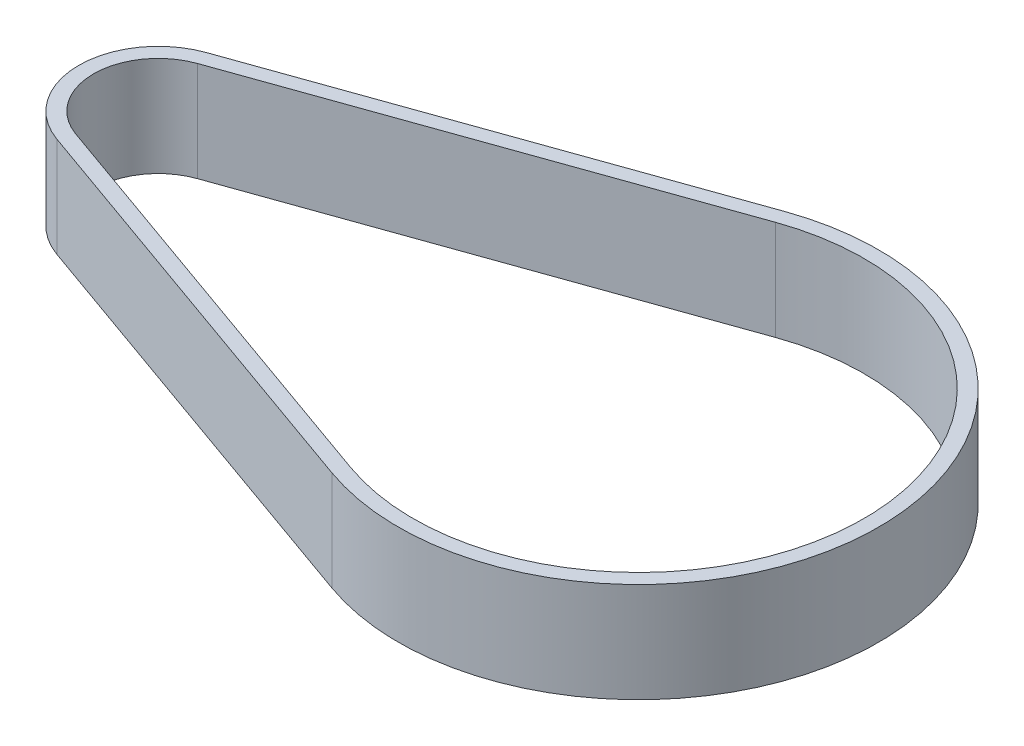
ISO-10303-21;
HEADER;
FILE_DESCRIPTION(('STEP AP214'),'2;1');
FILE_NAME('part.step','',(''),(''),'','','');
FILE_SCHEMA(('AUTOMOTIVE_DESIGN { 1 0 10303 214 1 1 1 1 }'));
ENDSEC;
DATA;
#1=APPLICATION_CONTEXT('core data for automotive mechanical design processes');
#2=APPLICATION_PROTOCOL_DEFINITION('international standard','automotive_design',2000,#1);
#3=PRODUCT_CONTEXT('',#1,'mechanical');
#4=PRODUCT('Part','Part','',(#3));
#5=PRODUCT_RELATED_PRODUCT_CATEGORY('part','',(#4));
#6=PRODUCT_DEFINITION_FORMATION('','',#4);
#7=PRODUCT_DEFINITION_CONTEXT('part definition',#1,'design');
#8=PRODUCT_DEFINITION('design','',#6,#7);
#9=PRODUCT_DEFINITION_SHAPE('','',#8);
#10=(LENGTH_UNIT() NAMED_UNIT(*) SI_UNIT(.MILLI.,.METRE.));
#11=(NAMED_UNIT(*) PLANE_ANGLE_UNIT() SI_UNIT($,.RADIAN.));
#12=(NAMED_UNIT(*) SI_UNIT($,.STERADIAN.) SOLID_ANGLE_UNIT());
#13=UNCERTAINTY_MEASURE_WITH_UNIT(LENGTH_MEASURE(1.E-05),#10,'distance_accuracy_value','');
#14=(GEOMETRIC_REPRESENTATION_CONTEXT(3) GLOBAL_UNCERTAINTY_ASSIGNED_CONTEXT((#13)) GLOBAL_UNIT_ASSIGNED_CONTEXT((#10,
#11,#12)) REPRESENTATION_CONTEXT('',''));
#15=CARTESIAN_POINT('',(0.,0.,0.));
#16=DIRECTION('',(0.,0.,1.));
#17=DIRECTION('',(1.,0.,0.));
#18=AXIS2_PLACEMENT_3D('',#15,#16,#17);
#19=CARTESIAN_POINT('',(0.,-28.75,0.));
#20=DIRECTION('',(0.,1.,0.));
#21=DIRECTION('',(0.,0.,1.));
#22=AXIS2_PLACEMENT_3D('',#19,#20,#21);
#23=CYLINDRICAL_SURFACE('',#22,65.0024145);
#24=CARTESIAN_POINT('',(0.,-1.74999999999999,0.));
#25=DIRECTION('',(0.,1.,0.));
#26=DIRECTION('',(-1.,0.,0.));
#27=AXIS2_PLACEMENT_3D('',#24,#25,#26);
#28=CIRCLE('',#27,65.0024145);
#29=CARTESIAN_POINT('',(-21.7520152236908,-1.74999999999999,61.2549077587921));
#30=VERTEX_POINT('',#29);
#31=CARTESIAN_POINT('',(-21.7520152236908,-1.74999999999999,-61.2549077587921));
#32=VERTEX_POINT('',#31);
#33=EDGE_CURVE('E128',#30,#32,#28,.T.);
#34=ORIENTED_EDGE('',*,*,#33,.F.);
#35=DIRECTION('',(0.,1.,0.));
#36=VECTOR('',#35,1.);
#37=CARTESIAN_POINT('',(-21.7520152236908,-28.75,61.2549077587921));
#38=LINE('',#37,#36);
#39=CARTESIAN_POINT('',(-21.7520152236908,-28.75,61.2549077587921));
#40=VERTEX_POINT('',#39);
#41=EDGE_CURVE('E11',#40,#30,#38,.T.);
#42=ORIENTED_EDGE('',*,*,#41,.F.);
#43=CARTESIAN_POINT('',(0.,-28.75,0.));
#44=DIRECTION('',(0.,1.,0.));
#45=DIRECTION('',(-1.,0.,0.));
#46=AXIS2_PLACEMENT_3D('',#43,#44,#45);
#47=CIRCLE('',#46,65.0024145);
#48=CARTESIAN_POINT('',(-21.7520152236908,-28.75,-61.2549077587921));
#49=VERTEX_POINT('',#48);
#50=EDGE_CURVE('E142',#40,#49,#47,.T.);
#51=ORIENTED_EDGE('',*,*,#50,.T.);
#52=DIRECTION('',(0.,1.,0.));
#53=VECTOR('',#52,1.);
#54=CARTESIAN_POINT('',(-21.7520152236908,-28.75,-61.2549077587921));
#55=LINE('',#54,#53);
#56=EDGE_CURVE('E32',#49,#32,#55,.T.);
#57=ORIENTED_EDGE('',*,*,#56,.T.);
#58=EDGE_LOOP('',(#34,#42,#51,#57));
#59=FACE_BOUND('',#58,.T.);
#60=ADVANCED_FACE('F29',(#59),#23,.T.);
#61=CARTESIAN_POINT('',(-21.7520152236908,-28.75,61.2549077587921));
#62=DIRECTION('',(-0.334633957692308,0.,0.942348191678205));
#63=DIRECTION('',(0.942348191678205,0.,0.334633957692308));
#64=AXIS2_PLACEMENT_3D('',#61,#62,#63);
#65=PLANE('',#64);
#66=DIRECTION('',(0.942348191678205,0.,0.334633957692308));
#67=VECTOR('',#66,1.);
#68=CARTESIAN_POINT('',(-21.7520152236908,-1.74999999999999,61.2549077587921));
#69=LINE('',#68,#67);
#70=CARTESIAN_POINT('',(-137.194630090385,-1.74999999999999,20.2604861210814));
#71=VERTEX_POINT('',#70);
#72=EDGE_CURVE('E139',#71,#30,#69,.T.);
#73=ORIENTED_EDGE('',*,*,#72,.F.);
#74=DIRECTION('',(0.,1.,0.));
#75=VECTOR('',#74,1.);
#76=CARTESIAN_POINT('',(-137.194630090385,-28.75,20.2604861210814));
#77=LINE('',#76,#75);
#78=CARTESIAN_POINT('',(-137.194630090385,-28.75,20.2604861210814));
#79=VERTEX_POINT('',#78);
#80=EDGE_CURVE('E37',#79,#71,#77,.T.);
#81=ORIENTED_EDGE('',*,*,#80,.F.);
#82=DIRECTION('',(0.942348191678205,0.,0.334633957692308));
#83=VECTOR('',#82,1.);
#84=CARTESIAN_POINT('',(-21.7520152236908,-28.75,61.2549077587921));
#85=LINE('',#84,#83);
#86=EDGE_CURVE('E151',#79,#40,#85,.T.);
#87=ORIENTED_EDGE('',*,*,#86,.T.);
#88=ORIENTED_EDGE('',*,*,#41,.T.);
#89=EDGE_LOOP('',(#73,#81,#87,#88));
#90=FACE_BOUND('',#89,.T.);
#91=ADVANCED_FACE('F165',(#90),#65,.T.);
#92=CARTESIAN_POINT('',(-130.,-28.75,0.));
#93=DIRECTION('',(0.,1.,0.));
#94=DIRECTION('',(0.,0.,1.));
#95=AXIS2_PLACEMENT_3D('',#92,#93,#94);
#96=CYLINDRICAL_SURFACE('',#95,21.5);
#97=CARTESIAN_POINT('',(-130.,-1.74999999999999,0.));
#98=DIRECTION('',(0.,1.,0.));
#99=DIRECTION('',(-1.,0.,0.));
#100=AXIS2_PLACEMENT_3D('',#97,#98,#99);
#101=CIRCLE('',#100,21.5);
#102=CARTESIAN_POINT('',(-137.194630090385,-1.74999999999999,-20.2604861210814));
#103=VERTEX_POINT('',#102);
#104=EDGE_CURVE('E136',#103,#71,#101,.T.);
#105=ORIENTED_EDGE('',*,*,#104,.F.);
#106=DIRECTION('',(0.,1.,0.));
#107=VECTOR('',#106,1.);
#108=CARTESIAN_POINT('',(-137.194630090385,-28.75,-20.2604861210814));
#109=LINE('',#108,#107);
#110=CARTESIAN_POINT('',(-137.194630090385,-28.75,-20.2604861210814));
#111=VERTEX_POINT('',#110);
#112=EDGE_CURVE('E154',#111,#103,#109,.T.);
#113=ORIENTED_EDGE('',*,*,#112,.F.);
#114=CARTESIAN_POINT('',(-130.,-28.75,0.));
#115=DIRECTION('',(0.,1.,0.));
#116=DIRECTION('',(-1.,0.,0.));
#117=AXIS2_PLACEMENT_3D('',#114,#115,#116);
#118=CIRCLE('',#117,21.5);
#119=EDGE_CURVE('E148',#111,#79,#118,.T.);
#120=ORIENTED_EDGE('',*,*,#119,.T.);
#121=ORIENTED_EDGE('',*,*,#80,.T.);
#122=EDGE_LOOP('',(#105,#113,#120,#121));
#123=FACE_BOUND('',#122,.T.);
#124=ADVANCED_FACE('F171',(#123),#96,.T.);
#125=CARTESIAN_POINT('',(-21.7520152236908,-28.75,-61.2549077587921));
#126=DIRECTION('',(-0.334633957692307,0.,-0.942348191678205));
#127=DIRECTION('',(-0.942348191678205,0.,0.334633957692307));
#128=AXIS2_PLACEMENT_3D('',#125,#126,#127);
#129=PLANE('',#128);
#130=DIRECTION('',(-0.942348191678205,0.,0.334633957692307));
#131=VECTOR('',#130,1.);
#132=CARTESIAN_POINT('',(-21.7520152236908,-1.74999999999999,-61.2549077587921));
#133=LINE('',#132,#131);
#134=EDGE_CURVE('E133',#32,#103,#133,.T.);
#135=ORIENTED_EDGE('',*,*,#134,.F.);
#136=ORIENTED_EDGE('',*,*,#56,.F.);
#137=DIRECTION('',(-0.942348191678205,0.,0.334633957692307));
#138=VECTOR('',#137,1.);
#139=CARTESIAN_POINT('',(-21.7520152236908,-28.75,-61.2549077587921));
#140=LINE('',#139,#138);
#141=EDGE_CURVE('E145',#49,#111,#140,.T.);
#142=ORIENTED_EDGE('',*,*,#141,.T.);
#143=ORIENTED_EDGE('',*,*,#112,.T.);
#144=EDGE_LOOP('',(#135,#136,#142,#143));
#145=FACE_BOUND('',#144,.T.);
#146=ADVANCED_FACE('F162',(#145),#129,.T.);
#147=CARTESIAN_POINT('',(0.,-28.75,0.));
#148=DIRECTION('',(0.,1.,0.));
#149=DIRECTION('',(0.,0.,1.));
#150=AXIS2_PLACEMENT_3D('',#147,#148,#149);
#151=PLANE('',#150);
#152=DIRECTION('',(0.942348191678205,0.,0.334633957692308));
#153=VECTOR('',#152,1.);
#154=CARTESIAN_POINT('',(-20.4134793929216,-28.75,57.4855149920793));
#155=LINE('',#154,#153);
#156=CARTESIAN_POINT('',(-135.856094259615,-28.75,16.4910933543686));
#157=VERTEX_POINT('',#156);
#158=CARTESIAN_POINT('',(-20.4134793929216,-28.75,57.4855149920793));
#159=VERTEX_POINT('',#158);
#160=EDGE_CURVE('E123',#157,#159,#155,.T.);
#161=ORIENTED_EDGE('',*,*,#160,.T.);
#162=CARTESIAN_POINT('',(0.,-28.75,0.));
#163=DIRECTION('',(0.,1.,0.));
#164=DIRECTION('',(0.,0.,1.));
#165=AXIS2_PLACEMENT_3D('',#162,#163,#164);
#166=CIRCLE('',#165,61.0024145);
#167=CARTESIAN_POINT('',(-20.4134793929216,-28.75,-57.4855149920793));
#168=VERTEX_POINT('',#167);
#169=EDGE_CURVE('E114',#159,#168,#166,.T.);
#170=ORIENTED_EDGE('',*,*,#169,.T.);
#171=DIRECTION('',(-0.942348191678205,0.,0.334633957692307));
#172=VECTOR('',#171,1.);
#173=CARTESIAN_POINT('',(-20.4134793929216,-28.75,-57.4855149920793));
#174=LINE('',#173,#172);
#175=CARTESIAN_POINT('',(-135.856094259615,-28.75,-16.4910933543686));
#176=VERTEX_POINT('',#175);
#177=EDGE_CURVE('E120',#168,#176,#174,.T.);
#178=ORIENTED_EDGE('',*,*,#177,.T.);
#179=CARTESIAN_POINT('',(-130.,-28.75,0.));
#180=DIRECTION('',(0.,1.,0.));
#181=DIRECTION('',(0.,0.,1.));
#182=AXIS2_PLACEMENT_3D('',#179,#180,#181);
#183=CIRCLE('',#182,17.5);
#184=EDGE_CURVE('E45',#176,#157,#183,.T.);
#185=ORIENTED_EDGE('',*,*,#184,.T.);
#186=EDGE_LOOP('',(#161,#170,#178,#185));
#187=FACE_BOUND('',#186,.T.);
#188=ORIENTED_EDGE('',*,*,#50,.F.);
#189=ORIENTED_EDGE('',*,*,#86,.F.);
#190=ORIENTED_EDGE('',*,*,#119,.F.);
#191=ORIENTED_EDGE('',*,*,#141,.F.);
#192=EDGE_LOOP('',(#188,#189,#190,#191));
#193=FACE_BOUND('',#192,.T.);
#194=ADVANCED_FACE('F168',(#187,#193),#151,.F.);
#195=CARTESIAN_POINT('',(0.,-1.74999999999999,0.));
#196=DIRECTION('',(0.,1.,0.));
#197=DIRECTION('',(0.,0.,1.));
#198=AXIS2_PLACEMENT_3D('',#195,#196,#197);
#199=PLANE('',#198);
#200=CARTESIAN_POINT('',(0.,-1.74999999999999,0.));
#201=DIRECTION('',(0.,1.,0.));
#202=DIRECTION('',(0.,0.,1.));
#203=AXIS2_PLACEMENT_3D('',#200,#201,#202);
#204=CIRCLE('',#203,61.0024145);
#205=CARTESIAN_POINT('',(-20.4134793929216,-1.74999999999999,57.4855149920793));
#206=VERTEX_POINT('',#205);
#207=CARTESIAN_POINT('',(-20.4134793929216,-1.74999999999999,-57.4855149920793));
#208=VERTEX_POINT('',#207);
#209=EDGE_CURVE('E53',#206,#208,#204,.T.);
#210=ORIENTED_EDGE('',*,*,#209,.F.);
#211=DIRECTION('',(0.942348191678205,0.,0.334633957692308));
#212=VECTOR('',#211,1.);
#213=CARTESIAN_POINT('',(-20.4134793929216,-1.74999999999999,57.4855149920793));
#214=LINE('',#213,#212);
#215=CARTESIAN_POINT('',(-135.856094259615,-1.74999999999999,16.4910933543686));
#216=VERTEX_POINT('',#215);
#217=EDGE_CURVE('E112',#216,#206,#214,.T.);
#218=ORIENTED_EDGE('',*,*,#217,.F.);
#219=CARTESIAN_POINT('',(-130.,-1.74999999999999,0.));
#220=DIRECTION('',(0.,1.,0.));
#221=DIRECTION('',(0.,0.,1.));
#222=AXIS2_PLACEMENT_3D('',#219,#220,#221);
#223=CIRCLE('',#222,17.5);
#224=CARTESIAN_POINT('',(-135.856094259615,-1.74999999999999,-16.4910933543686));
#225=VERTEX_POINT('',#224);
#226=EDGE_CURVE('E96',#225,#216,#223,.T.);
#227=ORIENTED_EDGE('',*,*,#226,.F.);
#228=DIRECTION('',(-0.942348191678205,0.,0.334633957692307));
#229=VECTOR('',#228,1.);
#230=CARTESIAN_POINT('',(-20.4134793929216,-1.74999999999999,-57.4855149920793));
#231=LINE('',#230,#229);
#232=EDGE_CURVE('E105',#208,#225,#231,.T.);
#233=ORIENTED_EDGE('',*,*,#232,.F.);
#234=EDGE_LOOP('',(#210,#218,#227,#233));
#235=FACE_BOUND('',#234,.T.);
#236=ORIENTED_EDGE('',*,*,#33,.T.);
#237=ORIENTED_EDGE('',*,*,#134,.T.);
#238=ORIENTED_EDGE('',*,*,#104,.T.);
#239=ORIENTED_EDGE('',*,*,#72,.T.);
#240=EDGE_LOOP('',(#236,#237,#238,#239));
#241=FACE_BOUND('',#240,.T.);
#242=ADVANCED_FACE('F109',(#235,#241),#199,.T.);
#243=CARTESIAN_POINT('',(0.,-28.75,0.));
#244=DIRECTION('',(0.,1.,0.));
#245=DIRECTION('',(0.,0.,1.));
#246=AXIS2_PLACEMENT_3D('',#243,#244,#245);
#247=CYLINDRICAL_SURFACE('',#246,61.0024145);
#248=ORIENTED_EDGE('',*,*,#209,.T.);
#249=DIRECTION('',(0.,1.,0.));
#250=VECTOR('',#249,1.);
#251=CARTESIAN_POINT('',(-20.4134793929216,-28.75,-57.4855149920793));
#252=LINE('',#251,#250);
#253=EDGE_CURVE('E102',#168,#208,#252,.T.);
#254=ORIENTED_EDGE('',*,*,#253,.F.);
#255=ORIENTED_EDGE('',*,*,#169,.F.);
#256=DIRECTION('',(0.,1.,0.));
#257=VECTOR('',#256,1.);
#258=CARTESIAN_POINT('',(-20.4134793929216,-28.75,57.4855149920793));
#259=LINE('',#258,#257);
#260=EDGE_CURVE('E126',#159,#206,#259,.T.);
#261=ORIENTED_EDGE('',*,*,#260,.T.);
#262=EDGE_LOOP('',(#248,#254,#255,#261));
#263=FACE_BOUND('',#262,.T.);
#264=ADVANCED_FACE('F214',(#263),#247,.F.);
#265=CARTESIAN_POINT('',(-20.4134793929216,-28.75,57.4855149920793));
#266=DIRECTION('',(-0.334633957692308,0.,0.942348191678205));
#267=DIRECTION('',(0.942348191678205,0.,0.334633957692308));
#268=AXIS2_PLACEMENT_3D('',#265,#266,#267);
#269=PLANE('',#268);
#270=ORIENTED_EDGE('',*,*,#217,.T.);
#271=ORIENTED_EDGE('',*,*,#260,.F.);
#272=ORIENTED_EDGE('',*,*,#160,.F.);
#273=DIRECTION('',(0.,1.,0.));
#274=VECTOR('',#273,1.);
#275=CARTESIAN_POINT('',(-135.856094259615,-28.75,16.4910933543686));
#276=LINE('',#275,#274);
#277=EDGE_CURVE('E101',#157,#216,#276,.T.);
#278=ORIENTED_EDGE('',*,*,#277,.T.);
#279=EDGE_LOOP('',(#270,#271,#272,#278));
#280=FACE_BOUND('',#279,.T.);
#281=ADVANCED_FACE('F223',(#280),#269,.F.);
#282=CARTESIAN_POINT('',(-130.,-28.75,0.));
#283=DIRECTION('',(0.,1.,0.));
#284=DIRECTION('',(0.,0.,1.));
#285=AXIS2_PLACEMENT_3D('',#282,#283,#284);
#286=CYLINDRICAL_SURFACE('',#285,17.5);
#287=ORIENTED_EDGE('',*,*,#226,.T.);
#288=ORIENTED_EDGE('',*,*,#277,.F.);
#289=ORIENTED_EDGE('',*,*,#184,.F.);
#290=DIRECTION('',(0.,1.,0.));
#291=VECTOR('',#290,1.);
#292=CARTESIAN_POINT('',(-135.856094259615,-28.75,-16.4910933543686));
#293=LINE('',#292,#291);
#294=EDGE_CURVE('E92',#176,#225,#293,.T.);
#295=ORIENTED_EDGE('',*,*,#294,.T.);
#296=EDGE_LOOP('',(#287,#288,#289,#295));
#297=FACE_BOUND('',#296,.T.);
#298=ADVANCED_FACE('F94',(#297),#286,.F.);
#299=CARTESIAN_POINT('',(-20.4134793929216,-28.75,-57.4855149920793));
#300=DIRECTION('',(-0.334633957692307,0.,-0.942348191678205));
#301=DIRECTION('',(-0.942348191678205,0.,0.334633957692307));
#302=AXIS2_PLACEMENT_3D('',#299,#300,#301);
#303=PLANE('',#302);
#304=ORIENTED_EDGE('',*,*,#232,.T.);
#305=ORIENTED_EDGE('',*,*,#294,.F.);
#306=ORIENTED_EDGE('',*,*,#177,.F.);
#307=ORIENTED_EDGE('',*,*,#253,.T.);
#308=EDGE_LOOP('',(#304,#305,#306,#307));
#309=FACE_BOUND('',#308,.T.);
#310=ADVANCED_FACE('F106',(#309),#303,.F.);
#311=CLOSED_SHELL('',(#60,#91,#124,#146,#194,#242,#264,#281,#298,#310));
#312=MANIFOLD_SOLID_BREP('B2',#311);
#313=ADVANCED_BREP_SHAPE_REPRESENTATION('',(#18,#312),#14);
#314=SHAPE_DEFINITION_REPRESENTATION(#9,#313);
ENDSEC;
END-ISO-10303-21;
